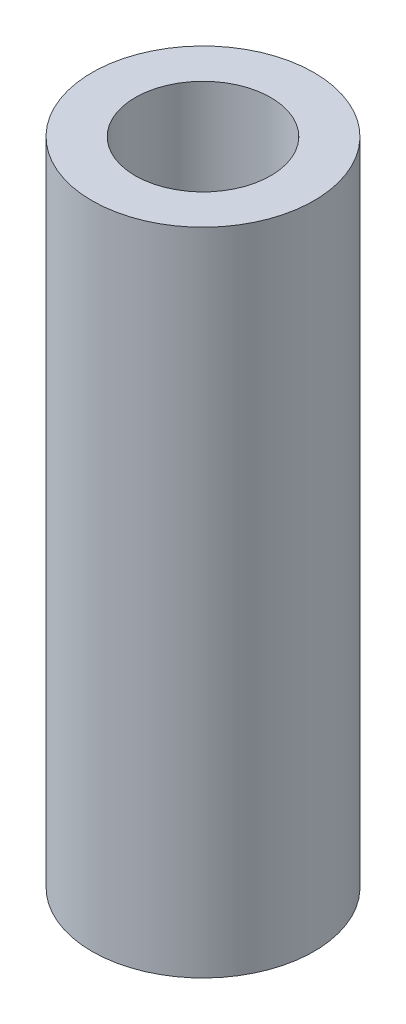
from build123d import *

# Parameters (mm, degrees)
SKETCH1_R           = 4.0767
SKETCH1_R_2         = 2.4892
BOSS_EXTRUDE1_DEPTH = 11.938


with BuildPart() as part:
    # Sketch1 → Boss-Extrude1 (new, symmetric)
    with BuildSketch(Plane(origin=(0, 0, 0), x_dir=(1, 0, 0), z_dir=(0, 1, 0))):
        with Locations(Location((0, 0, 0), (0, 0, 270))):
            Circle(SKETCH1_R)
        with Locations(Location((0, 0, 0), (0, 0, 270))):
            Circle(SKETCH1_R_2, mode=Mode.SUBTRACT)
    extrude(amount=BOSS_EXTRUDE1_DEPTH, both=True)


solid = part.part
